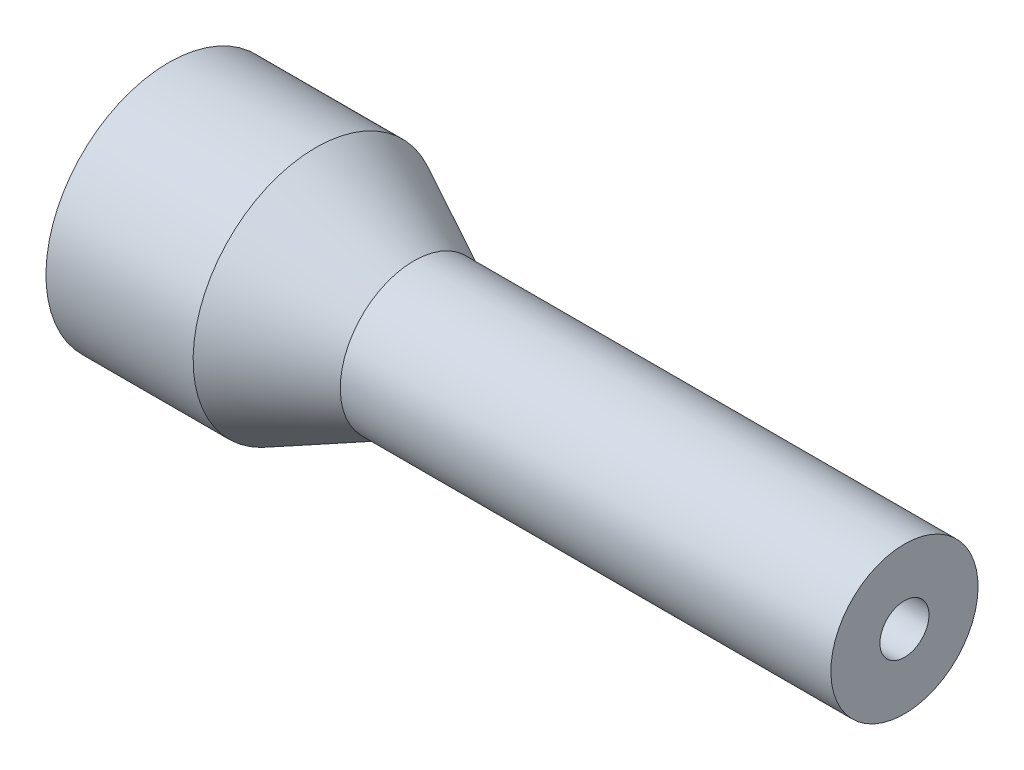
ISO-10303-21;
HEADER;
FILE_DESCRIPTION(('STEP AP214'),'2;1');
FILE_NAME('part.step','',(''),(''),'','','');
FILE_SCHEMA(('AUTOMOTIVE_DESIGN { 1 0 10303 214 1 1 1 1 }'));
ENDSEC;
DATA;
#1=APPLICATION_CONTEXT('core data for automotive mechanical design processes');
#2=APPLICATION_PROTOCOL_DEFINITION('international standard','automotive_design',2000,#1);
#3=PRODUCT_CONTEXT('',#1,'mechanical');
#4=PRODUCT('Part','Part','',(#3));
#5=PRODUCT_RELATED_PRODUCT_CATEGORY('part','',(#4));
#6=PRODUCT_DEFINITION_FORMATION('','',#4);
#7=PRODUCT_DEFINITION_CONTEXT('part definition',#1,'design');
#8=PRODUCT_DEFINITION('design','',#6,#7);
#9=PRODUCT_DEFINITION_SHAPE('','',#8);
#10=(LENGTH_UNIT() NAMED_UNIT(*) SI_UNIT(.MILLI.,.METRE.));
#11=(NAMED_UNIT(*) PLANE_ANGLE_UNIT() SI_UNIT($,.RADIAN.));
#12=(NAMED_UNIT(*) SI_UNIT($,.STERADIAN.) SOLID_ANGLE_UNIT());
#13=UNCERTAINTY_MEASURE_WITH_UNIT(LENGTH_MEASURE(1.E-05),#10,'distance_accuracy_value','');
#14=(GEOMETRIC_REPRESENTATION_CONTEXT(3) GLOBAL_UNCERTAINTY_ASSIGNED_CONTEXT((#13)) GLOBAL_UNIT_ASSIGNED_CONTEXT((#10,
#11,#12)) REPRESENTATION_CONTEXT('',''));
#15=CARTESIAN_POINT('',(0.,0.,0.));
#16=DIRECTION('',(0.,0.,1.));
#17=DIRECTION('',(1.,0.,0.));
#18=AXIS2_PLACEMENT_3D('',#15,#16,#17);
#19=CARTESIAN_POINT('',(25.,0.,0.));
#20=DIRECTION('',(1.,0.,0.));
#21=DIRECTION('',(0.,1.,0.));
#22=AXIS2_PLACEMENT_3D('',#19,#20,#21);
#23=CYLINDRICAL_SURFACE('',#22,19.);
#24=CARTESIAN_POINT('',(25.,0.,0.));
#25=DIRECTION('',(1.,0.,0.));
#26=DIRECTION('',(0.,1.,0.));
#27=AXIS2_PLACEMENT_3D('',#24,#25,#26);
#28=CIRCLE('',#27,19.);
#29=CARTESIAN_POINT('',(25.,19.,0.));
#30=VERTEX_POINT('',#29);
#31=EDGE_CURVE('E66',#30,#30,#28,.T.);
#32=ORIENTED_EDGE('',*,*,#31,.T.);
#33=EDGE_LOOP('',(#32));
#34=FACE_BOUND('',#33,.T.);
#35=CARTESIAN_POINT('',(0.,0.,0.));
#36=DIRECTION('',(1.,0.,0.));
#37=DIRECTION('',(0.,1.,0.));
#38=AXIS2_PLACEMENT_3D('',#35,#36,#37);
#39=CIRCLE('',#38,19.);
#40=CARTESIAN_POINT('',(0.,19.,0.));
#41=VERTEX_POINT('',#40);
#42=EDGE_CURVE('E11',#41,#41,#39,.T.);
#43=ORIENTED_EDGE('',*,*,#42,.F.);
#44=EDGE_LOOP('',(#43));
#45=FACE_BOUND('',#44,.T.);
#46=ADVANCED_FACE('F30',(#34,#45),#23,.F.);
#47=CARTESIAN_POINT('',(0.,19.,0.));
#48=DIRECTION('',(-1.,0.,0.));
#49=DIRECTION('',(0.,-1.,0.));
#50=AXIS2_PLACEMENT_3D('',#47,#48,#49);
#51=PLANE('',#50);
#52=ORIENTED_EDGE('',*,*,#42,.T.);
#53=EDGE_LOOP('',(#52));
#54=FACE_BOUND('',#53,.T.);
#55=CARTESIAN_POINT('',(0.,0.,0.));
#56=DIRECTION('',(1.,0.,0.));
#57=DIRECTION('',(0.,1.,0.));
#58=AXIS2_PLACEMENT_3D('',#55,#56,#57);
#59=CIRCLE('',#58,25.);
#60=CARTESIAN_POINT('',(0.,25.,0.));
#61=VERTEX_POINT('',#60);
#62=EDGE_CURVE('E36',#61,#61,#59,.T.);
#63=ORIENTED_EDGE('',*,*,#62,.F.);
#64=EDGE_LOOP('',(#63));
#65=FACE_BOUND('',#64,.T.);
#66=ADVANCED_FACE('F56',(#54,#65),#51,.T.);
#67=CARTESIAN_POINT('',(25.,0.,0.));
#68=DIRECTION('',(1.,0.,0.));
#69=DIRECTION('',(0.,1.,0.));
#70=AXIS2_PLACEMENT_3D('',#67,#68,#69);
#71=CYLINDRICAL_SURFACE('',#70,25.);
#72=ORIENTED_EDGE('',*,*,#62,.T.);
#73=EDGE_LOOP('',(#72));
#74=FACE_BOUND('',#73,.T.);
#75=CARTESIAN_POINT('',(30.,0.,0.));
#76=DIRECTION('',(1.,0.,0.));
#77=DIRECTION('',(0.,1.,0.));
#78=AXIS2_PLACEMENT_3D('',#75,#76,#77);
#79=CIRCLE('',#78,25.);
#80=CARTESIAN_POINT('',(30.,25.,0.));
#81=VERTEX_POINT('',#80);
#82=EDGE_CURVE('E72',#81,#81,#79,.T.);
#83=ORIENTED_EDGE('',*,*,#82,.F.);
#84=EDGE_LOOP('',(#83));
#85=FACE_BOUND('',#84,.T.);
#86=ADVANCED_FACE('F61',(#74,#85),#71,.T.);
#87=CARTESIAN_POINT('',(50.,0.,0.));
#88=DIRECTION('',(-1.,0.,0.));
#89=DIRECTION('',(0.,-1.,0.));
#90=AXIS2_PLACEMENT_3D('',#87,#88,#89);
#91=CONICAL_SURFACE('',#90,15.,0.463647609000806);
#92=ORIENTED_EDGE('',*,*,#82,.T.);
#93=EDGE_LOOP('',(#92));
#94=FACE_BOUND('',#93,.T.);
#95=CARTESIAN_POINT('',(50.,0.,0.));
#96=DIRECTION('',(1.,0.,0.));
#97=DIRECTION('',(0.,1.,0.));
#98=AXIS2_PLACEMENT_3D('',#95,#96,#97);
#99=CIRCLE('',#98,15.);
#100=CARTESIAN_POINT('',(50.,15.,0.));
#101=VERTEX_POINT('',#100);
#102=EDGE_CURVE('E74',#101,#101,#99,.T.);
#103=ORIENTED_EDGE('',*,*,#102,.F.);
#104=EDGE_LOOP('',(#103));
#105=FACE_BOUND('',#104,.T.);
#106=ADVANCED_FACE('F98',(#94,#105),#91,.T.);
#107=CARTESIAN_POINT('',(25.,0.,0.));
#108=DIRECTION('',(1.,0.,0.));
#109=DIRECTION('',(0.,1.,0.));
#110=AXIS2_PLACEMENT_3D('',#107,#108,#109);
#111=CYLINDRICAL_SURFACE('',#110,15.);
#112=ORIENTED_EDGE('',*,*,#102,.T.);
#113=EDGE_LOOP('',(#112));
#114=FACE_BOUND('',#113,.T.);
#115=CARTESIAN_POINT('',(150.,0.,0.));
#116=DIRECTION('',(1.,0.,0.));
#117=DIRECTION('',(0.,1.,0.));
#118=AXIS2_PLACEMENT_3D('',#115,#116,#117);
#119=CIRCLE('',#118,15.);
#120=CARTESIAN_POINT('',(150.,15.,0.));
#121=VERTEX_POINT('',#120);
#122=EDGE_CURVE('E79',#121,#121,#119,.T.);
#123=ORIENTED_EDGE('',*,*,#122,.F.);
#124=EDGE_LOOP('',(#123));
#125=FACE_BOUND('',#124,.T.);
#126=ADVANCED_FACE('F92',(#114,#125),#111,.T.);
#127=CARTESIAN_POINT('',(150.,15.,0.));
#128=DIRECTION('',(1.,0.,0.));
#129=DIRECTION('',(0.,1.,0.));
#130=AXIS2_PLACEMENT_3D('',#127,#128,#129);
#131=PLANE('',#130);
#132=ORIENTED_EDGE('',*,*,#122,.T.);
#133=EDGE_LOOP('',(#132));
#134=FACE_BOUND('',#133,.T.);
#135=CARTESIAN_POINT('',(150.,0.,0.));
#136=DIRECTION('',(1.,0.,0.));
#137=DIRECTION('',(0.,1.,0.));
#138=AXIS2_PLACEMENT_3D('',#135,#136,#137);
#139=CIRCLE('',#138,5.00000000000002);
#140=CARTESIAN_POINT('',(150.,5.00000000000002,0.));
#141=VERTEX_POINT('',#140);
#142=EDGE_CURVE('E82',#141,#141,#139,.T.);
#143=ORIENTED_EDGE('',*,*,#142,.F.);
#144=EDGE_LOOP('',(#143));
#145=FACE_BOUND('',#144,.T.);
#146=ADVANCED_FACE('F51',(#134,#145),#131,.T.);
#147=CARTESIAN_POINT('',(25.,0.,0.));
#148=DIRECTION('',(1.,0.,0.));
#149=DIRECTION('',(0.,1.,0.));
#150=AXIS2_PLACEMENT_3D('',#147,#148,#149);
#151=CYLINDRICAL_SURFACE('',#150,5.00000000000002);
#152=ORIENTED_EDGE('',*,*,#142,.T.);
#153=EDGE_LOOP('',(#152));
#154=FACE_BOUND('',#153,.T.);
#155=CARTESIAN_POINT('',(130.,0.,0.));
#156=DIRECTION('',(1.,0.,0.));
#157=DIRECTION('',(0.,1.,0.));
#158=AXIS2_PLACEMENT_3D('',#155,#156,#157);
#159=CIRCLE('',#158,5.00000000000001);
#160=CARTESIAN_POINT('',(130.,5.00000000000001,0.));
#161=VERTEX_POINT('',#160);
#162=EDGE_CURVE('E85',#161,#161,#159,.T.);
#163=ORIENTED_EDGE('',*,*,#162,.F.);
#164=EDGE_LOOP('',(#163));
#165=FACE_BOUND('',#164,.T.);
#166=ADVANCED_FACE('F42',(#154,#165),#151,.F.);
#167=CARTESIAN_POINT('',(127.113248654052,0.,0.));
#168=DIRECTION('',(1.,0.,0.));
#169=DIRECTION('',(0.,1.,0.));
#170=AXIS2_PLACEMENT_3D('',#167,#168,#169);
#171=CONICAL_SURFACE('',#170,0.,1.0471975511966);
#172=ORIENTED_EDGE('',*,*,#162,.T.);
#173=EDGE_LOOP('',(#172));
#174=FACE_BOUND('',#173,.T.);
#175=CARTESIAN_POINT('',(127.113248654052,0.,0.));
#176=VERTEX_POINT('',#175);
#177=VERTEX_LOOP('',#176);
#178=FACE_BOUND('',#177,.T.);
#179=ADVANCED_FACE('F39',(#174,#178),#171,.F.);
#180=CARTESIAN_POINT('',(25.,0.,0.));
#181=DIRECTION('',(-1.,0.,0.));
#182=DIRECTION('',(0.,-1.,0.));
#183=AXIS2_PLACEMENT_3D('',#180,#181,#182);
#184=PLANE('',#183);
#185=ORIENTED_EDGE('',*,*,#31,.F.);
#186=EDGE_LOOP('',(#185));
#187=FACE_BOUND('',#186,.T.);
#188=ADVANCED_FACE('F41',(#187),#184,.T.);
#189=CLOSED_SHELL('',(#46,#66,#86,#106,#126,#146,#166,#179,#188));
#190=MANIFOLD_SOLID_BREP('B2',#189);
#191=ADVANCED_BREP_SHAPE_REPRESENTATION('',(#18,#190),#14);
#192=SHAPE_DEFINITION_REPRESENTATION(#9,#191);
ENDSEC;
END-ISO-10303-21;
